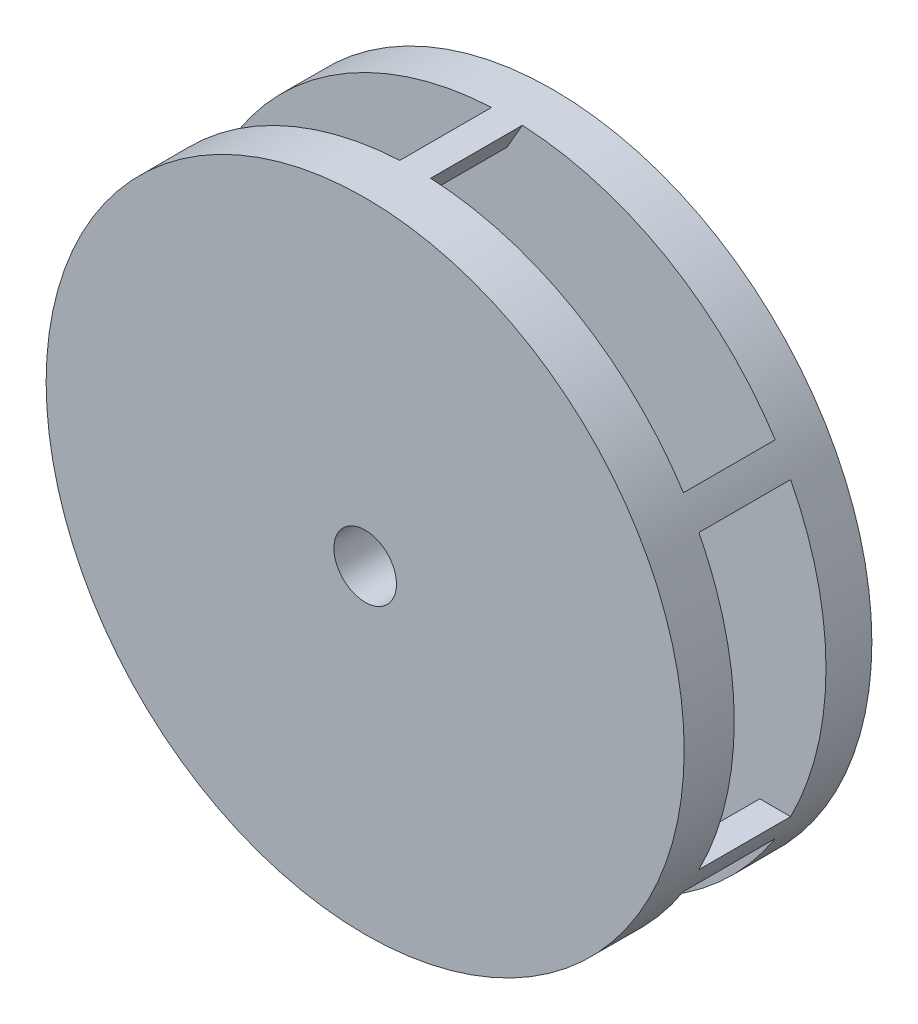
ISO-10303-21;
HEADER;
FILE_DESCRIPTION(('STEP AP214'),'2;1');
FILE_NAME('part.step','',(''),(''),'','','');
FILE_SCHEMA(('AUTOMOTIVE_DESIGN { 1 0 10303 214 1 1 1 1 }'));
ENDSEC;
DATA;
#1=APPLICATION_CONTEXT('core data for automotive mechanical design processes');
#2=APPLICATION_PROTOCOL_DEFINITION('international standard','automotive_design',2000,#1);
#3=PRODUCT_CONTEXT('',#1,'mechanical');
#4=PRODUCT('Part','Part','',(#3));
#5=PRODUCT_RELATED_PRODUCT_CATEGORY('part','',(#4));
#6=PRODUCT_DEFINITION_FORMATION('','',#4);
#7=PRODUCT_DEFINITION_CONTEXT('part definition',#1,'design');
#8=PRODUCT_DEFINITION('design','',#6,#7);
#9=PRODUCT_DEFINITION_SHAPE('','',#8);
#10=(LENGTH_UNIT() NAMED_UNIT(*) SI_UNIT(.MILLI.,.METRE.));
#11=(NAMED_UNIT(*) PLANE_ANGLE_UNIT() SI_UNIT($,.RADIAN.));
#12=(NAMED_UNIT(*) SI_UNIT($,.STERADIAN.) SOLID_ANGLE_UNIT());
#13=UNCERTAINTY_MEASURE_WITH_UNIT(LENGTH_MEASURE(1.E-05),#10,'distance_accuracy_value','');
#14=(GEOMETRIC_REPRESENTATION_CONTEXT(3) GLOBAL_UNCERTAINTY_ASSIGNED_CONTEXT((#13)) GLOBAL_UNIT_ASSIGNED_CONTEXT((#10,
#11,#12)) REPRESENTATION_CONTEXT('',''));
#15=CARTESIAN_POINT('',(0.,0.,0.));
#16=DIRECTION('',(0.,0.,1.));
#17=DIRECTION('',(1.,0.,0.));
#18=AXIS2_PLACEMENT_3D('',#15,#16,#17);
#19=CARTESIAN_POINT('',(-82.5620438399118,73.0016547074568,33.));
#20=DIRECTION('',(-0.86602540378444,-0.499999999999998,0.));
#21=DIRECTION('',(0.499999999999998,-0.86602540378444,0.));
#22=AXIS2_PLACEMENT_3D('',#19,#20,#21);
#23=PLANE('',#22);
#24=DIRECTION('',(0.499999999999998,-0.86602540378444,0.));
#25=VECTOR('',#24,1.);
#26=CARTESIAN_POINT('',(-82.5620438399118,73.0016547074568,11.));
#27=LINE('',#26,#25);
#28=CARTESIAN_POINT('',(-2.46330733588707E-13,-69.9999999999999,11.));
#29=VERTEX_POINT('',#28);
#30=CARTESIAN_POINT('',(3.70105729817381,-76.410419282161,11.));
#31=VERTEX_POINT('',#30);
#32=EDGE_CURVE('E257',#29,#31,#27,.T.);
#33=ORIENTED_EDGE('',*,*,#32,.F.);
#34=DIRECTION('',(0.,0.,1.));
#35=VECTOR('',#34,1.);
#36=CARTESIAN_POINT('',(-2.4980018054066E-13,-69.9999999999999,33.));
#37=LINE('',#36,#35);
#38=CARTESIAN_POINT('',(-2.35922392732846E-13,-69.9999999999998,33.));
#39=VERTEX_POINT('',#38);
#40=EDGE_CURVE('E217',#29,#39,#37,.T.);
#41=ORIENTED_EDGE('',*,*,#40,.T.);
#42=DIRECTION('',(0.499999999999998,-0.86602540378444,0.));
#43=VECTOR('',#42,1.);
#44=CARTESIAN_POINT('',(-82.5620438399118,73.0016547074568,33.));
#45=LINE('',#44,#43);
#46=CARTESIAN_POINT('',(3.70105729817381,-76.410419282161,33.));
#47=VERTEX_POINT('',#46);
#48=EDGE_CURVE('E261',#39,#47,#45,.T.);
#49=ORIENTED_EDGE('',*,*,#48,.T.);
#50=DIRECTION('',(0.,0.,-1.));
#51=VECTOR('',#50,1.);
#52=CARTESIAN_POINT('',(3.7010572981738,-76.410419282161,45.));
#53=LINE('',#52,#51);
#54=EDGE_CURVE('E245',#47,#31,#53,.T.);
#55=ORIENTED_EDGE('',*,*,#54,.T.);
#56=EDGE_LOOP('',(#33,#41,#49,#55));
#57=FACE_BOUND('',#56,.T.);
#58=ADVANCED_FACE('F31',(#57),#23,.F.);
#59=CARTESIAN_POINT('',(-21.940265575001,108.001654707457,11.));
#60=DIRECTION('',(0.86602540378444,0.499999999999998,0.));
#61=DIRECTION('',(-0.499999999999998,0.86602540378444,0.));
#62=AXIS2_PLACEMENT_3D('',#59,#60,#61);
#63=PLANE('',#62);
#64=DIRECTION('',(0.499999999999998,-0.86602540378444,0.));
#65=VECTOR('',#64,1.);
#66=CARTESIAN_POINT('',(-21.940265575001,108.001654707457,33.));
#67=LINE('',#66,#65);
#68=CARTESIAN_POINT('',(60.6217782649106,-35.,33.));
#69=VERTEX_POINT('',#68);
#70=CARTESIAN_POINT('',(64.3228355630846,-41.4104192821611,33.));
#71=VERTEX_POINT('',#70);
#72=EDGE_CURVE('E265',#69,#71,#67,.T.);
#73=ORIENTED_EDGE('',*,*,#72,.F.);
#74=DIRECTION('',(0.,0.,-1.));
#75=VECTOR('',#74,1.);
#76=CARTESIAN_POINT('',(60.6217782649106,-35.,11.));
#77=LINE('',#76,#75);
#78=CARTESIAN_POINT('',(60.6217782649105,-35.,11.));
#79=VERTEX_POINT('',#78);
#80=EDGE_CURVE('E178',#69,#79,#77,.T.);
#81=ORIENTED_EDGE('',*,*,#80,.T.);
#82=DIRECTION('',(0.499999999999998,-0.86602540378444,0.));
#83=VECTOR('',#82,1.);
#84=CARTESIAN_POINT('',(-21.940265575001,108.001654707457,11.));
#85=LINE('',#84,#83);
#86=CARTESIAN_POINT('',(64.3228355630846,-41.4104192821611,11.));
#87=VERTEX_POINT('',#86);
#88=EDGE_CURVE('E253',#79,#87,#85,.T.);
#89=ORIENTED_EDGE('',*,*,#88,.T.);
#90=DIRECTION('',(0.,0.,-1.));
#91=VECTOR('',#90,1.);
#92=CARTESIAN_POINT('',(64.3228355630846,-41.4104192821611,45.));
#93=LINE('',#92,#91);
#94=EDGE_CURVE('E239',#87,#71,#93,.F.);
#95=ORIENTED_EDGE('',*,*,#94,.T.);
#96=EDGE_LOOP('',(#73,#81,#89,#95));
#97=FACE_BOUND('',#96,.T.);
#98=ADVANCED_FACE('F296',(#97),#63,.F.);
#99=CARTESIAN_POINT('',(0.,0.,-15.));
#100=DIRECTION('',(0.,0.,1.));
#101=DIRECTION('',(1.,0.,0.));
#102=AXIS2_PLACEMENT_3D('',#99,#100,#101);
#103=CYLINDRICAL_SURFACE('',#102,30.5);
#104=CARTESIAN_POINT('',(0.,0.,-15.));
#105=DIRECTION('',(0.,0.,-1.));
#106=DIRECTION('',(-1.,0.,0.));
#107=AXIS2_PLACEMENT_3D('',#104,#105,#106);
#108=CIRCLE('',#107,30.5);
#109=CARTESIAN_POINT('',(-30.5,0.,-15.));
#110=VERTEX_POINT('',#109);
#111=EDGE_CURVE('E427',#110,#110,#108,.T.);
#112=ORIENTED_EDGE('',*,*,#111,.F.);
#113=EDGE_LOOP('',(#112));
#114=FACE_BOUND('',#113,.T.);
#115=CARTESIAN_POINT('',(0.,0.,-9.));
#116=DIRECTION('',(0.,0.,1.));
#117=DIRECTION('',(1.,0.,0.));
#118=AXIS2_PLACEMENT_3D('',#115,#116,#117);
#119=CIRCLE('',#118,30.5);
#120=CARTESIAN_POINT('',(30.5,0.,-9.));
#121=VERTEX_POINT('',#120);
#122=EDGE_CURVE('E420',#121,#121,#119,.T.);
#123=ORIENTED_EDGE('',*,*,#122,.F.);
#124=EDGE_LOOP('',(#123));
#125=FACE_BOUND('',#124,.T.);
#126=ADVANCED_FACE('F292',(#114,#125),#103,.T.);
#127=CARTESIAN_POINT('',(0.,0.,-15.));
#128=DIRECTION('',(0.,0.,-1.));
#129=DIRECTION('',(-1.,0.,0.));
#130=AXIS2_PLACEMENT_3D('',#127,#128,#129);
#131=PLANE('',#130);
#132=ORIENTED_EDGE('',*,*,#111,.T.);
#133=EDGE_LOOP('',(#132));
#134=FACE_BOUND('',#133,.T.);
#135=CARTESIAN_POINT('',(0.,0.,-15.));
#136=DIRECTION('',(0.,0.,-1.));
#137=DIRECTION('',(-1.,0.,0.));
#138=AXIS2_PLACEMENT_3D('',#135,#136,#137);
#139=CIRCLE('',#138,25.5);
#140=CARTESIAN_POINT('',(-25.5,0.,-15.));
#141=VERTEX_POINT('',#140);
#142=EDGE_CURVE('E256',#141,#141,#139,.T.);
#143=ORIENTED_EDGE('',*,*,#142,.F.);
#144=EDGE_LOOP('',(#143));
#145=FACE_BOUND('',#144,.T.);
#146=ADVANCED_FACE('F288',(#134,#145),#131,.T.);
#147=CARTESIAN_POINT('',(0.,0.,-15.));
#148=DIRECTION('',(0.,0.,1.));
#149=DIRECTION('',(1.,0.,0.));
#150=AXIS2_PLACEMENT_3D('',#147,#148,#149);
#151=CYLINDRICAL_SURFACE('',#150,25.5);
#152=ORIENTED_EDGE('',*,*,#142,.T.);
#153=EDGE_LOOP('',(#152));
#154=FACE_BOUND('',#153,.T.);
#155=CARTESIAN_POINT('',(0.,0.,11.));
#156=DIRECTION('',(0.,0.,-1.));
#157=DIRECTION('',(-1.,0.,0.));
#158=AXIS2_PLACEMENT_3D('',#155,#156,#157);
#159=CIRCLE('',#158,25.5);
#160=CARTESIAN_POINT('',(-25.5,0.,11.));
#161=VERTEX_POINT('',#160);
#162=EDGE_CURVE('E358',#161,#161,#159,.F.);
#163=ORIENTED_EDGE('',*,*,#162,.T.);
#164=EDGE_LOOP('',(#163));
#165=FACE_BOUND('',#164,.T.);
#166=ADVANCED_FACE('F283',(#154,#165),#151,.F.);
#167=CARTESIAN_POINT('',(-30.5,0.,-9.));
#168=CARTESIAN_POINT('',(-38.5213748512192,0.,-2.27671658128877));
#169=CARTESIAN_POINT('',(-65.5,0.,0.));
#170=B_SPLINE_CURVE_WITH_KNOTS('',2,(#167,#168,#169),.UNSPECIFIED.,.F.,.F.,(3,3),(0.,
0.452791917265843),.UNSPECIFIED.);
#171=CARTESIAN_POINT('',(0.,0.,0.));
#172=DIRECTION('',(0.,0.,1.));
#173=AXIS1_PLACEMENT('',#171,#172);
#174=SURFACE_OF_REVOLUTION('',#170,#173);
#175=CARTESIAN_POINT('',(0.,0.,0.));
#176=DIRECTION('',(0.,0.,1.));
#177=DIRECTION('',(1.,0.,0.));
#178=AXIS2_PLACEMENT_3D('',#175,#176,#177);
#179=CIRCLE('',#178,65.5);
#180=CARTESIAN_POINT('',(65.5,0.,0.));
#181=VERTEX_POINT('',#180);
#182=EDGE_CURVE('E424',#181,#181,#179,.F.);
#183=ORIENTED_EDGE('',*,*,#182,.T.);
#184=EDGE_LOOP('',(#183));
#185=FACE_BOUND('',#184,.T.);
#186=ORIENTED_EDGE('',*,*,#122,.T.);
#187=EDGE_LOOP('',(#186));
#188=FACE_BOUND('',#187,.T.);
#189=ADVANCED_FACE('F278',(#185,#188),#174,.T.);
#190=CARTESIAN_POINT('',(0.,0.,45.));
#191=DIRECTION('',(0.,0.,1.));
#192=DIRECTION('',(1.,0.,0.));
#193=AXIS2_PLACEMENT_3D('',#190,#191,#192);
#194=PLANE('',#193);
#195=CARTESIAN_POINT('',(0.,0.,45.));
#196=DIRECTION('',(0.,0.,1.));
#197=DIRECTION('',(1.,0.,0.));
#198=AXIS2_PLACEMENT_3D('',#195,#196,#197);
#199=CIRCLE('',#198,7.5);
#200=CARTESIAN_POINT('',(7.5,0.,45.));
#201=VERTEX_POINT('',#200);
#202=EDGE_CURVE('E410',#201,#201,#199,.T.);
#203=ORIENTED_EDGE('',*,*,#202,.F.);
#204=EDGE_LOOP('',(#203));
#205=FACE_BOUND('',#204,.T.);
#206=CARTESIAN_POINT('',(0.,0.,45.));
#207=DIRECTION('',(0.,0.,1.));
#208=DIRECTION('',(1.,0.,0.));
#209=AXIS2_PLACEMENT_3D('',#206,#207,#208);
#210=CIRCLE('',#209,76.5);
#211=CARTESIAN_POINT('',(76.5,0.,45.));
#212=VERTEX_POINT('',#211);
#213=EDGE_CURVE('E419',#212,#212,#210,.T.);
#214=ORIENTED_EDGE('',*,*,#213,.T.);
#215=EDGE_LOOP('',(#214));
#216=FACE_BOUND('',#215,.T.);
#217=ADVANCED_FACE('F282',(#205,#216),#194,.T.);
#218=CARTESIAN_POINT('',(0.,0.,45.));
#219=DIRECTION('',(0.,0.,-1.));
#220=DIRECTION('',(-1.,0.,0.));
#221=AXIS2_PLACEMENT_3D('',#218,#219,#220);
#222=CYLINDRICAL_SURFACE('',#221,76.5);
#223=DIRECTION('',(0.,0.,-1.));
#224=VECTOR('',#223,1.);
#225=CARTESIAN_POINT('',(-68.0238928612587,35.,45.));
#226=LINE('',#225,#224);
#227=CARTESIAN_POINT('',(-68.0238928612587,35.,11.));
#228=VERTEX_POINT('',#227);
#229=CARTESIAN_POINT('',(-68.0238928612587,35.,33.));
#230=VERTEX_POINT('',#229);
#231=EDGE_CURVE('E190',#228,#230,#226,.F.);
#232=ORIENTED_EDGE('',*,*,#231,.T.);
#233=CARTESIAN_POINT('',(0.,0.,33.));
#234=DIRECTION('',(0.,0.,1.));
#235=DIRECTION('',(0.,-1.,0.));
#236=AXIS2_PLACEMENT_3D('',#233,#234,#235);
#237=CIRCLE('',#236,76.5);
#238=CARTESIAN_POINT('',(-68.0238928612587,-35.,33.));
#239=VERTEX_POINT('',#238);
#240=EDGE_CURVE('E177',#230,#239,#237,.T.);
#241=ORIENTED_EDGE('',*,*,#240,.T.);
#242=DIRECTION('',(0.,0.,-1.));
#243=VECTOR('',#242,1.);
#244=CARTESIAN_POINT('',(-68.0238928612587,-35.,45.));
#245=LINE('',#244,#243);
#246=CARTESIAN_POINT('',(-68.0238928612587,-35.,11.));
#247=VERTEX_POINT('',#246);
#248=EDGE_CURVE('E171',#239,#247,#245,.T.);
#249=ORIENTED_EDGE('',*,*,#248,.T.);
#250=CARTESIAN_POINT('',(0.,0.,11.));
#251=DIRECTION('',(0.,0.,-1.));
#252=DIRECTION('',(-1.,0.,0.));
#253=AXIS2_PLACEMENT_3D('',#250,#251,#252);
#254=CIRCLE('',#253,76.5);
#255=EDGE_CURVE('E155',#247,#228,#254,.T.);
#256=ORIENTED_EDGE('',*,*,#255,.T.);
#257=EDGE_LOOP('',(#232,#241,#249,#256));
#258=FACE_BOUND('',#257,.T.);
#259=DIRECTION('',(0.,0.,-1.));
#260=VECTOR('',#259,1.);
#261=CARTESIAN_POINT('',(68.0238928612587,35.,45.));
#262=LINE('',#261,#260);
#263=CARTESIAN_POINT('',(68.0238928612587,35.,33.));
#264=VERTEX_POINT('',#263);
#265=CARTESIAN_POINT('',(68.0238928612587,35.,11.));
#266=VERTEX_POINT('',#265);
#267=EDGE_CURVE('E192',#264,#266,#262,.T.);
#268=ORIENTED_EDGE('',*,*,#267,.T.);
#269=CARTESIAN_POINT('',(68.0238928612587,-35.,11.));
#270=VERTEX_POINT('',#269);
#271=EDGE_CURVE('E46',#266,#270,#254,.T.);
#272=ORIENTED_EDGE('',*,*,#271,.T.);
#273=DIRECTION('',(0.,0.,-1.));
#274=VECTOR('',#273,1.);
#275=CARTESIAN_POINT('',(68.0238928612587,-35.,45.));
#276=LINE('',#275,#274);
#277=CARTESIAN_POINT('',(68.0238928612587,-35.,33.));
#278=VERTEX_POINT('',#277);
#279=EDGE_CURVE('E179',#270,#278,#276,.F.);
#280=ORIENTED_EDGE('',*,*,#279,.T.);
#281=EDGE_CURVE('E184',#278,#264,#237,.T.);
#282=ORIENTED_EDGE('',*,*,#281,.T.);
#283=EDGE_LOOP('',(#268,#272,#280,#282));
#284=FACE_BOUND('',#283,.T.);
#285=CARTESIAN_POINT('',(0.,0.,33.));
#286=DIRECTION('',(0.,0.,1.));
#287=DIRECTION('',(1.,0.,0.));
#288=AXIS2_PLACEMENT_3D('',#285,#286,#287);
#289=CIRCLE('',#288,76.5);
#290=CARTESIAN_POINT('',(-64.3228355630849,-41.4104192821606,33.));
#291=VERTEX_POINT('',#290);
#292=CARTESIAN_POINT('',(-3.70105729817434,-76.4104192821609,33.));
#293=VERTEX_POINT('',#292);
#294=EDGE_CURVE('E230',#291,#293,#289,.T.);
#295=ORIENTED_EDGE('',*,*,#294,.T.);
#296=DIRECTION('',(0.,0.,-1.));
#297=VECTOR('',#296,1.);
#298=CARTESIAN_POINT('',(-3.70105729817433,-76.4104192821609,45.));
#299=LINE('',#298,#297);
#300=CARTESIAN_POINT('',(-3.70105729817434,-76.4104192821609,11.));
#301=VERTEX_POINT('',#300);
#302=EDGE_CURVE('E223',#293,#301,#299,.T.);
#303=ORIENTED_EDGE('',*,*,#302,.T.);
#304=CARTESIAN_POINT('',(0.,0.,11.));
#305=DIRECTION('',(0.,0.,-1.));
#306=DIRECTION('',(-1.,0.,0.));
#307=AXIS2_PLACEMENT_3D('',#304,#305,#306);
#308=CIRCLE('',#307,76.5);
#309=CARTESIAN_POINT('',(-64.3228355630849,-41.4104192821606,11.));
#310=VERTEX_POINT('',#309);
#311=EDGE_CURVE('E226',#301,#310,#308,.T.);
#312=ORIENTED_EDGE('',*,*,#311,.T.);
#313=DIRECTION('',(0.,0.,-1.));
#314=VECTOR('',#313,1.);
#315=CARTESIAN_POINT('',(-64.3228355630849,-41.4104192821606,45.));
#316=LINE('',#315,#314);
#317=EDGE_CURVE('E211',#310,#291,#316,.F.);
#318=ORIENTED_EDGE('',*,*,#317,.T.);
#319=EDGE_LOOP('',(#295,#303,#312,#318));
#320=FACE_BOUND('',#319,.T.);
#321=DIRECTION('',(0.,0.,-1.));
#322=VECTOR('',#321,1.);
#323=CARTESIAN_POINT('',(3.70105729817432,76.4104192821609,45.));
#324=LINE('',#323,#322);
#325=CARTESIAN_POINT('',(3.70105729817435,76.410419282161,33.));
#326=VERTEX_POINT('',#325);
#327=CARTESIAN_POINT('',(3.70105729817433,76.4104192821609,11.));
#328=VERTEX_POINT('',#327);
#329=EDGE_CURVE('E214',#326,#328,#324,.T.);
#330=ORIENTED_EDGE('',*,*,#329,.T.);
#331=CARTESIAN_POINT('',(64.3228355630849,41.4104192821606,11.));
#332=VERTEX_POINT('',#331);
#333=EDGE_CURVE('E229',#328,#332,#308,.T.);
#334=ORIENTED_EDGE('',*,*,#333,.T.);
#335=DIRECTION('',(0.,0.,-1.));
#336=VECTOR('',#335,1.);
#337=CARTESIAN_POINT('',(64.3228355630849,41.4104192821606,45.));
#338=LINE('',#337,#336);
#339=CARTESIAN_POINT('',(64.3228355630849,41.4104192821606,33.));
#340=VERTEX_POINT('',#339);
#341=EDGE_CURVE('E220',#332,#340,#338,.F.);
#342=ORIENTED_EDGE('',*,*,#341,.T.);
#343=EDGE_CURVE('E233',#340,#326,#289,.T.);
#344=ORIENTED_EDGE('',*,*,#343,.T.);
#345=EDGE_LOOP('',(#330,#334,#342,#344));
#346=FACE_BOUND('',#345,.T.);
#347=CARTESIAN_POINT('',(0.,0.,33.));
#348=DIRECTION('',(0.,0.,1.));
#349=DIRECTION('',(1.,0.,0.));
#350=AXIS2_PLACEMENT_3D('',#347,#348,#349);
#351=CIRCLE('',#350,76.5);
#352=CARTESIAN_POINT('',(-64.3228355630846,41.4104192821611,33.));
#353=VERTEX_POINT('',#352);
#354=CARTESIAN_POINT('',(-3.70105729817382,76.4104192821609,33.));
#355=VERTEX_POINT('',#354);
#356=EDGE_CURVE('E246',#353,#355,#351,.F.);
#357=ORIENTED_EDGE('',*,*,#356,.F.);
#358=DIRECTION('',(0.,0.,-1.));
#359=VECTOR('',#358,1.);
#360=CARTESIAN_POINT('',(-64.3228355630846,41.4104192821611,45.));
#361=LINE('',#360,#359);
#362=CARTESIAN_POINT('',(-64.3228355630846,41.4104192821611,11.));
#363=VERTEX_POINT('',#362);
#364=EDGE_CURVE('E250',#363,#353,#361,.F.);
#365=ORIENTED_EDGE('',*,*,#364,.F.);
#366=CARTESIAN_POINT('',(0.,0.,11.));
#367=DIRECTION('',(0.,0.,-1.));
#368=DIRECTION('',(-1.,0.,0.));
#369=AXIS2_PLACEMENT_3D('',#366,#367,#368);
#370=CIRCLE('',#369,76.5);
#371=CARTESIAN_POINT('',(-3.70105729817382,76.410419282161,11.));
#372=VERTEX_POINT('',#371);
#373=EDGE_CURVE('E234',#372,#363,#370,.F.);
#374=ORIENTED_EDGE('',*,*,#373,.F.);
#375=DIRECTION('',(0.,0.,-1.));
#376=VECTOR('',#375,1.);
#377=CARTESIAN_POINT('',(-3.70105729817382,76.410419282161,45.));
#378=LINE('',#377,#376);
#379=EDGE_CURVE('E237',#355,#372,#378,.T.);
#380=ORIENTED_EDGE('',*,*,#379,.F.);
#381=EDGE_LOOP('',(#357,#365,#374,#380));
#382=FACE_BOUND('',#381,.T.);
#383=EDGE_CURVE('E238',#31,#87,#370,.F.);
#384=ORIENTED_EDGE('',*,*,#383,.F.);
#385=ORIENTED_EDGE('',*,*,#54,.F.);
#386=EDGE_CURVE('E242',#71,#47,#351,.F.);
#387=ORIENTED_EDGE('',*,*,#386,.F.);
#388=ORIENTED_EDGE('',*,*,#94,.F.);
#389=EDGE_LOOP('',(#384,#385,#387,#388));
#390=FACE_BOUND('',#389,.T.);
#391=ORIENTED_EDGE('',*,*,#213,.F.);
#392=EDGE_LOOP('',(#391));
#393=FACE_BOUND('',#392,.T.);
#394=CARTESIAN_POINT('',(0.,0.,0.));
#395=DIRECTION('',(0.,0.,1.));
#396=DIRECTION('',(1.,0.,0.));
#397=AXIS2_PLACEMENT_3D('',#394,#395,#396);
#398=CIRCLE('',#397,76.5);
#399=CARTESIAN_POINT('',(76.5,0.,0.));
#400=VERTEX_POINT('',#399);
#401=EDGE_CURVE('E421',#400,#400,#398,.T.);
#402=ORIENTED_EDGE('',*,*,#401,.T.);
#403=EDGE_LOOP('',(#402));
#404=FACE_BOUND('',#403,.T.);
#405=ADVANCED_FACE('F33',(#258,#284,#320,#346,#382,#390,#393,#404),#222,.T.);
#406=CARTESIAN_POINT('',(0.,0.,0.));
#407=DIRECTION('',(0.,0.,1.));
#408=DIRECTION('',(1.,0.,0.));
#409=AXIS2_PLACEMENT_3D('',#406,#407,#408);
#410=PLANE('',#409);
#411=ORIENTED_EDGE('',*,*,#401,.F.);
#412=EDGE_LOOP('',(#411));
#413=FACE_BOUND('',#412,.T.);
#414=ORIENTED_EDGE('',*,*,#182,.F.);
#415=EDGE_LOOP('',(#414));
#416=FACE_BOUND('',#415,.T.);
#417=ADVANCED_FACE('F300',(#413,#416),#410,.F.);
#418=CARTESIAN_POINT('',(-60.6217782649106,35.,33.));
#419=VERTEX_POINT('',#418);
#420=EDGE_CURVE('E258',#353,#419,#45,.T.);
#421=ORIENTED_EDGE('',*,*,#420,.T.);
#422=DIRECTION('',(0.,0.,-1.));
#423=VECTOR('',#422,1.);
#424=CARTESIAN_POINT('',(-60.6217782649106,35.,33.));
#425=LINE('',#424,#423);
#426=CARTESIAN_POINT('',(-60.6217782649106,35.,11.));
#427=VERTEX_POINT('',#426);
#428=EDGE_CURVE('E182',#419,#427,#425,.T.);
#429=ORIENTED_EDGE('',*,*,#428,.T.);
#430=EDGE_CURVE('E254',#363,#427,#27,.T.);
#431=ORIENTED_EDGE('',*,*,#430,.F.);
#432=ORIENTED_EDGE('',*,*,#364,.T.);
#433=EDGE_LOOP('',(#421,#429,#431,#432));
#434=FACE_BOUND('',#433,.T.);
#435=ADVANCED_FACE('F302',(#434),#23,.F.);
#436=CARTESIAN_POINT('',(-21.940265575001,108.001654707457,33.));
#437=DIRECTION('',(0.,0.,1.));
#438=DIRECTION('',(1.,0.,0.));
#439=AXIS2_PLACEMENT_3D('',#436,#437,#438);
#440=PLANE('',#439);
#441=CARTESIAN_POINT('',(0.,0.,33.));
#442=DIRECTION('',(0.,0.,1.));
#443=DIRECTION('',(1.,0.,0.));
#444=AXIS2_PLACEMENT_3D('',#441,#442,#443);
#445=CIRCLE('',#444,7.5);
#446=CARTESIAN_POINT('',(7.5,0.,33.));
#447=VERTEX_POINT('',#446);
#448=EDGE_CURVE('E407',#447,#447,#445,.F.);
#449=ORIENTED_EDGE('',*,*,#448,.F.);
#450=EDGE_LOOP('',(#449));
#451=FACE_BOUND('',#450,.T.);
#452=DIRECTION('',(1.,0.,0.));
#453=VECTOR('',#452,1.);
#454=CARTESIAN_POINT('',(-76.5,-35.,33.));
#455=LINE('',#454,#453);
#456=EDGE_CURVE('E350',#69,#278,#455,.T.);
#457=ORIENTED_EDGE('',*,*,#456,.F.);
#458=ORIENTED_EDGE('',*,*,#72,.T.);
#459=ORIENTED_EDGE('',*,*,#386,.T.);
#460=ORIENTED_EDGE('',*,*,#48,.F.);
#461=DIRECTION('',(0.500000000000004,0.866025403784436,0.));
#462=VECTOR('',#461,1.);
#463=CARTESIAN_POINT('',(-18.4391108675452,-101.937476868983,33.));
#464=LINE('',#463,#462);
#465=EDGE_CURVE('E198',#293,#39,#464,.T.);
#466=ORIENTED_EDGE('',*,*,#465,.F.);
#467=ORIENTED_EDGE('',*,*,#294,.F.);
#468=DIRECTION('',(0.500000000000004,0.866025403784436,0.));
#469=VECTOR('',#468,1.);
#470=CARTESIAN_POINT('',(-79.0608891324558,-66.9374768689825,33.));
#471=LINE('',#470,#469);
#472=CARTESIAN_POINT('',(-60.621778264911,-35.,33.));
#473=VERTEX_POINT('',#472);
#474=EDGE_CURVE('E201',#291,#473,#471,.T.);
#475=ORIENTED_EDGE('',*,*,#474,.T.);
#476=EDGE_CURVE('E354',#239,#473,#455,.T.);
#477=ORIENTED_EDGE('',*,*,#476,.F.);
#478=ORIENTED_EDGE('',*,*,#240,.F.);
#479=DIRECTION('',(1.,0.,0.));
#480=VECTOR('',#479,1.);
#481=CARTESIAN_POINT('',(-76.5,35.,33.));
#482=LINE('',#481,#480);
#483=EDGE_CURVE('E347',#230,#419,#482,.T.);
#484=ORIENTED_EDGE('',*,*,#483,.T.);
#485=ORIENTED_EDGE('',*,*,#420,.F.);
#486=ORIENTED_EDGE('',*,*,#356,.T.);
#487=CARTESIAN_POINT('',(2.4980018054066E-13,69.9999999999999,33.));
#488=VERTEX_POINT('',#487);
#489=EDGE_CURVE('E262',#355,#488,#67,.T.);
#490=ORIENTED_EDGE('',*,*,#489,.T.);
#491=EDGE_CURVE('E202',#488,#326,#471,.T.);
#492=ORIENTED_EDGE('',*,*,#491,.T.);
#493=ORIENTED_EDGE('',*,*,#343,.F.);
#494=CARTESIAN_POINT('',(60.621778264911,35.,33.));
#495=VERTEX_POINT('',#494);
#496=EDGE_CURVE('E199',#495,#340,#464,.T.);
#497=ORIENTED_EDGE('',*,*,#496,.F.);
#498=EDGE_CURVE('E351',#495,#264,#482,.T.);
#499=ORIENTED_EDGE('',*,*,#498,.T.);
#500=ORIENTED_EDGE('',*,*,#281,.F.);
#501=EDGE_LOOP('',(#457,#458,#459,#460,#466,#467,#475,#477,#478,#484,#485,#486,#490,#492,#493,
#497,#499,#500));
#502=FACE_BOUND('',#501,.T.);
#503=ADVANCED_FACE('F308',(#451,#502),#440,.F.);
#504=CARTESIAN_POINT('',(2.27248775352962E-13,69.9999999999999,11.));
#505=VERTEX_POINT('',#504);
#506=EDGE_CURVE('E266',#372,#505,#85,.T.);
#507=ORIENTED_EDGE('',*,*,#506,.T.);
#508=DIRECTION('',(0.,0.,1.));
#509=VECTOR('',#508,1.);
#510=CARTESIAN_POINT('',(2.39391839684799E-13,69.9999999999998,11.));
#511=LINE('',#510,#509);
#512=EDGE_CURVE('E208',#505,#488,#511,.T.);
#513=ORIENTED_EDGE('',*,*,#512,.T.);
#514=ORIENTED_EDGE('',*,*,#489,.F.);
#515=ORIENTED_EDGE('',*,*,#379,.T.);
#516=EDGE_LOOP('',(#507,#513,#514,#515));
#517=FACE_BOUND('',#516,.T.);
#518=ADVANCED_FACE('F319',(#517),#63,.F.);
#519=CARTESIAN_POINT('',(-52.2511547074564,90.5016547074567,11.));
#520=DIRECTION('',(0.,0.,-1.));
#521=DIRECTION('',(-1.,0.,0.));
#522=AXIS2_PLACEMENT_3D('',#519,#520,#521);
#523=PLANE('',#522);
#524=ORIENTED_EDGE('',*,*,#162,.F.);
#525=EDGE_LOOP('',(#524));
#526=FACE_BOUND('',#525,.T.);
#527=ORIENTED_EDGE('',*,*,#88,.F.);
#528=DIRECTION('',(1.,0.,0.));
#529=VECTOR('',#528,1.);
#530=CARTESIAN_POINT('',(-76.5,-35.,11.));
#531=LINE('',#530,#529);
#532=EDGE_CURVE('E175',#79,#270,#531,.T.);
#533=ORIENTED_EDGE('',*,*,#532,.T.);
#534=ORIENTED_EDGE('',*,*,#271,.F.);
#535=DIRECTION('',(1.,0.,0.));
#536=VECTOR('',#535,1.);
#537=CARTESIAN_POINT('',(-76.5,35.,11.));
#538=LINE('',#537,#536);
#539=CARTESIAN_POINT('',(60.6217782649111,35.,11.));
#540=VERTEX_POINT('',#539);
#541=EDGE_CURVE('E53',#540,#266,#538,.T.);
#542=ORIENTED_EDGE('',*,*,#541,.F.);
#543=DIRECTION('',(0.500000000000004,0.866025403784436,0.));
#544=VECTOR('',#543,1.);
#545=CARTESIAN_POINT('',(-18.4391108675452,-101.937476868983,11.));
#546=LINE('',#545,#544);
#547=EDGE_CURVE('E195',#540,#332,#546,.T.);
#548=ORIENTED_EDGE('',*,*,#547,.T.);
#549=ORIENTED_EDGE('',*,*,#333,.F.);
#550=DIRECTION('',(0.500000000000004,0.866025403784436,0.));
#551=VECTOR('',#550,1.);
#552=CARTESIAN_POINT('',(-79.0608891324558,-66.9374768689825,11.));
#553=LINE('',#552,#551);
#554=EDGE_CURVE('E194',#505,#328,#553,.T.);
#555=ORIENTED_EDGE('',*,*,#554,.F.);
#556=ORIENTED_EDGE('',*,*,#506,.F.);
#557=ORIENTED_EDGE('',*,*,#373,.T.);
#558=ORIENTED_EDGE('',*,*,#430,.T.);
#559=EDGE_CURVE('E162',#228,#427,#538,.T.);
#560=ORIENTED_EDGE('',*,*,#559,.F.);
#561=ORIENTED_EDGE('',*,*,#255,.F.);
#562=CARTESIAN_POINT('',(-60.621778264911,-35.,11.));
#563=VERTEX_POINT('',#562);
#564=EDGE_CURVE('E159',#247,#563,#531,.T.);
#565=ORIENTED_EDGE('',*,*,#564,.T.);
#566=EDGE_CURVE('E205',#310,#563,#553,.T.);
#567=ORIENTED_EDGE('',*,*,#566,.F.);
#568=ORIENTED_EDGE('',*,*,#311,.F.);
#569=EDGE_CURVE('E197',#301,#29,#546,.T.);
#570=ORIENTED_EDGE('',*,*,#569,.T.);
#571=ORIENTED_EDGE('',*,*,#32,.T.);
#572=ORIENTED_EDGE('',*,*,#383,.T.);
#573=EDGE_LOOP('',(#527,#533,#534,#542,#548,#549,#555,#556,#557,#558,#560,#561,#565,#567,#568,
#570,#571,#572));
#574=FACE_BOUND('',#573,.T.);
#575=ADVANCED_FACE('F158',(#526,#574),#523,.F.);
#576=CARTESIAN_POINT('',(-79.0608891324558,-66.9374768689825,11.));
#577=DIRECTION('',(-0.866025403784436,0.500000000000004,0.));
#578=DIRECTION('',(-0.500000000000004,-0.866025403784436,0.));
#579=AXIS2_PLACEMENT_3D('',#576,#577,#578);
#580=PLANE('',#579);
#581=ORIENTED_EDGE('',*,*,#491,.F.);
#582=ORIENTED_EDGE('',*,*,#512,.F.);
#583=ORIENTED_EDGE('',*,*,#554,.T.);
#584=ORIENTED_EDGE('',*,*,#329,.F.);
#585=EDGE_LOOP('',(#581,#582,#583,#584));
#586=FACE_BOUND('',#585,.T.);
#587=ADVANCED_FACE('F323',(#586),#580,.F.);
#588=CARTESIAN_POINT('',(-18.4391108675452,-101.937476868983,33.));
#589=DIRECTION('',(0.866025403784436,-0.500000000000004,0.));
#590=DIRECTION('',(0.500000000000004,0.866025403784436,0.));
#591=AXIS2_PLACEMENT_3D('',#588,#589,#590);
#592=PLANE('',#591);
#593=ORIENTED_EDGE('',*,*,#547,.F.);
#594=DIRECTION('',(0.,0.,1.));
#595=VECTOR('',#594,1.);
#596=CARTESIAN_POINT('',(60.621778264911,35.,33.));
#597=LINE('',#596,#595);
#598=EDGE_CURVE('E11',#540,#495,#597,.T.);
#599=ORIENTED_EDGE('',*,*,#598,.T.);
#600=ORIENTED_EDGE('',*,*,#496,.T.);
#601=ORIENTED_EDGE('',*,*,#341,.F.);
#602=EDGE_LOOP('',(#593,#599,#600,#601));
#603=FACE_BOUND('',#602,.T.);
#604=ADVANCED_FACE('F369',(#603),#592,.F.);
#605=ORIENTED_EDGE('',*,*,#465,.T.);
#606=ORIENTED_EDGE('',*,*,#40,.F.);
#607=ORIENTED_EDGE('',*,*,#569,.F.);
#608=ORIENTED_EDGE('',*,*,#302,.F.);
#609=EDGE_LOOP('',(#605,#606,#607,#608));
#610=FACE_BOUND('',#609,.T.);
#611=ADVANCED_FACE('F379',(#610),#592,.F.);
#612=ORIENTED_EDGE('',*,*,#566,.T.);
#613=DIRECTION('',(0.,0.,1.));
#614=VECTOR('',#613,1.);
#615=CARTESIAN_POINT('',(-60.621778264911,-35.,11.));
#616=LINE('',#615,#614);
#617=EDGE_CURVE('E39',#563,#473,#616,.T.);
#618=ORIENTED_EDGE('',*,*,#617,.T.);
#619=ORIENTED_EDGE('',*,*,#474,.F.);
#620=ORIENTED_EDGE('',*,*,#317,.F.);
#621=EDGE_LOOP('',(#612,#618,#619,#620));
#622=FACE_BOUND('',#621,.T.);
#623=ADVANCED_FACE('F375',(#622),#580,.F.);
#624=CARTESIAN_POINT('',(-76.5,-35.,33.));
#625=DIRECTION('',(0.,-1.,0.));
#626=DIRECTION('',(0.,0.,-1.));
#627=AXIS2_PLACEMENT_3D('',#624,#625,#626);
#628=PLANE('',#627);
#629=ORIENTED_EDGE('',*,*,#476,.T.);
#630=ORIENTED_EDGE('',*,*,#617,.F.);
#631=ORIENTED_EDGE('',*,*,#564,.F.);
#632=ORIENTED_EDGE('',*,*,#248,.F.);
#633=EDGE_LOOP('',(#629,#630,#631,#632));
#634=FACE_BOUND('',#633,.T.);
#635=ADVANCED_FACE('F170',(#634),#628,.F.);
#636=CARTESIAN_POINT('',(-76.5,35.,11.));
#637=DIRECTION('',(0.,1.,0.));
#638=DIRECTION('',(0.,0.,1.));
#639=AXIS2_PLACEMENT_3D('',#636,#637,#638);
#640=PLANE('',#639);
#641=ORIENTED_EDGE('',*,*,#559,.T.);
#642=ORIENTED_EDGE('',*,*,#428,.F.);
#643=ORIENTED_EDGE('',*,*,#483,.F.);
#644=ORIENTED_EDGE('',*,*,#231,.F.);
#645=EDGE_LOOP('',(#641,#642,#643,#644));
#646=FACE_BOUND('',#645,.T.);
#647=ADVANCED_FACE('F346',(#646),#640,.F.);
#648=ORIENTED_EDGE('',*,*,#498,.F.);
#649=ORIENTED_EDGE('',*,*,#598,.F.);
#650=ORIENTED_EDGE('',*,*,#541,.T.);
#651=ORIENTED_EDGE('',*,*,#267,.F.);
#652=EDGE_LOOP('',(#648,#649,#650,#651));
#653=FACE_BOUND('',#652,.T.);
#654=ADVANCED_FACE('F363',(#653),#640,.F.);
#655=ORIENTED_EDGE('',*,*,#456,.T.);
#656=ORIENTED_EDGE('',*,*,#279,.F.);
#657=ORIENTED_EDGE('',*,*,#532,.F.);
#658=ORIENTED_EDGE('',*,*,#80,.F.);
#659=EDGE_LOOP('',(#655,#656,#657,#658));
#660=FACE_BOUND('',#659,.T.);
#661=ADVANCED_FACE('F387',(#660),#628,.F.);
#662=CARTESIAN_POINT('',(0.,0.,-15.001));
#663=DIRECTION('',(0.,0.,1.));
#664=DIRECTION('',(1.,0.,0.));
#665=AXIS2_PLACEMENT_3D('',#662,#663,#664);
#666=CYLINDRICAL_SURFACE('',#665,7.5);
#667=ORIENTED_EDGE('',*,*,#202,.T.);
#668=EDGE_LOOP('',(#667));
#669=FACE_BOUND('',#668,.T.);
#670=ORIENTED_EDGE('',*,*,#448,.T.);
#671=EDGE_LOOP('',(#670));
#672=FACE_BOUND('',#671,.T.);
#673=ADVANCED_FACE('F414',(#669,#672),#666,.F.);
#674=CLOSED_SHELL('',(#58,#98,#126,#146,#166,#189,#217,#405,#417,#435,#503,#518,#575,#587,#604,
#611,#623,#635,#647,#654,#661,#673));
#675=MANIFOLD_SOLID_BREP('B2',#674);
#676=ADVANCED_BREP_SHAPE_REPRESENTATION('',(#18,#675),#14);
#677=SHAPE_DEFINITION_REPRESENTATION(#9,#676);
ENDSEC;
END-ISO-10303-21;
